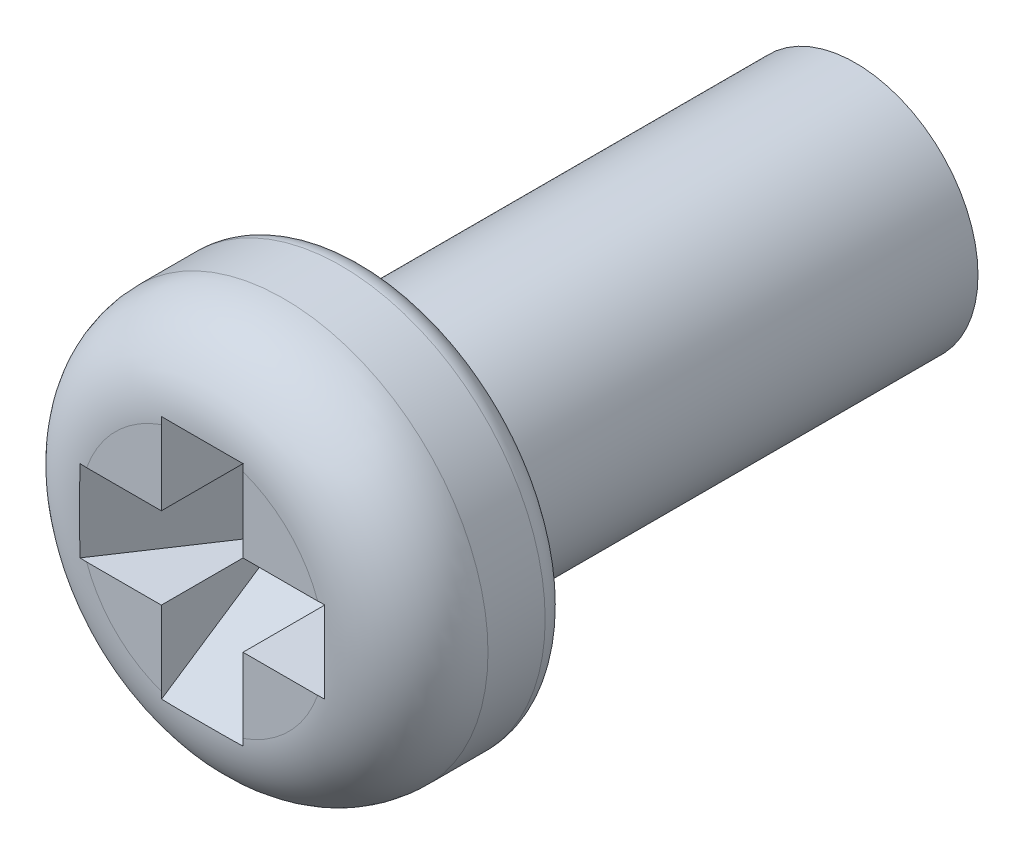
from build123d import *
from OCP.BRepFilletAPI import BRepFilletAPI_MakeFillet

# Parameters (mm, degrees)
ESQUISSE1_R                  = 1.5
CYLINDRE_DE_BASE_DEPTH       = 3
ESQUISSE2_R                  = 2.5
T_TE_DEPTH                   = 2
CONG_S_R1                    = 1
CONG_S_R2                    = 0.3
ENL_V_MAT_EXTRU_1_DEPTH      = 0.5
R_P_TITION_CIRCULAIRE1_COUNT = 2
R_P_TITION_CIRCULAIRE1_ANGLE = 90


with BuildPart() as part:
    # Esquisse1 → Cylindre de base (new, symmetric)
    with BuildSketch(Plane.XY):
        Circle(ESQUISSE1_R)
    extrude(amount=CYLINDRE_DE_BASE_DEPTH, both=True)

    # Esquisse2 → T_te (add)
    with BuildSketch(Plane.XY.offset(3)):
        Circle(ESQUISSE2_R)
    extrude(amount=T_TE_DEPTH)

    # Cong_s: one fillet with a radius per group of edges: ONE call of the kernel's fillet builder (fillet() takes one radius for all edges)
    cong_s_edges_1 = [part.edges().sort_by_distance(p)[0] for p in [
        (-2.5, 0, 5),
    ]]
    cong_s_edges_2 = [part.edges().sort_by_distance(p)[0] for p in [
        (-2.5, 0, 3),
    ]]
    cong_s = BRepFilletAPI_MakeFillet(part.part.solid().wrapped)
    for e in cong_s_edges_1:
        cong_s.Add(CONG_S_R1, e.wrapped)
    for e in cong_s_edges_2:
        cong_s.Add(CONG_S_R2, e.wrapped)
    add(Compound.cast(cong_s.Shape()), mode=Mode.REPLACE)

    # Esquisse3 → Enl_v. mat.-Extru.1 (cut, symmetric)
    with BuildSketch(Plane(origin=(0, 0, 0), x_dir=(1, 0, 0), z_dir=(0, 1, 0))):
        Polygon((1.5, -5), (0.5, -3.5), (-0.5, -3.5), (-1.5, -5), align=None)
    enl_v_mat_extru_1 = extrude(amount=ENL_V_MAT_EXTRU_1_DEPTH, both=True, mode=Mode.SUBTRACT)

    # R_p_tition circulaire1: Enl_v. mat.-Extru.1 ×2 about axis
    r_p_tition_circulaire1_axis = Axis((0, 0, 0), (0, 0, -1))
    for i in range(1, R_P_TITION_CIRCULAIRE1_COUNT):
        add(enl_v_mat_extru_1.rotate(r_p_tition_circulaire1_axis, i * R_P_TITION_CIRCULAIRE1_ANGLE / (R_P_TITION_CIRCULAIRE1_COUNT - 1)), mode=Mode.SUBTRACT)


solid = part.part
